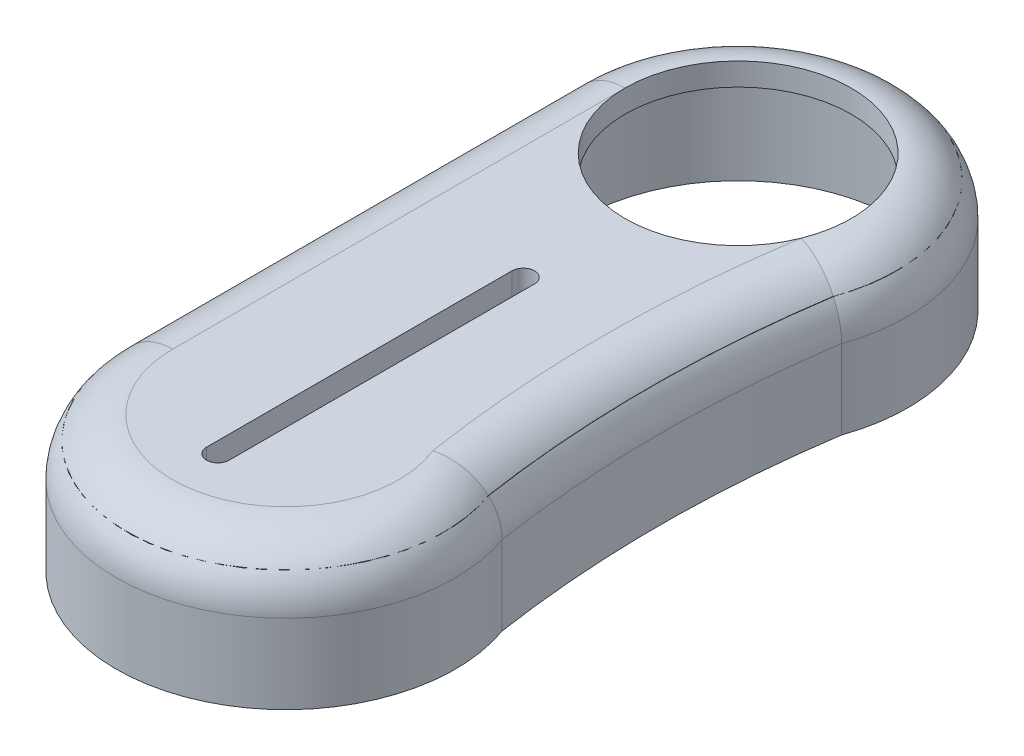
ISO-10303-21;
HEADER;
FILE_DESCRIPTION(('STEP AP214'),'2;1');
FILE_NAME('part.step','',(''),(''),'','','');
FILE_SCHEMA(('AUTOMOTIVE_DESIGN { 1 0 10303 214 1 1 1 1 }'));
ENDSEC;
DATA;
#1=APPLICATION_CONTEXT('core data for automotive mechanical design processes');
#2=APPLICATION_PROTOCOL_DEFINITION('international standard','automotive_design',2000,#1);
#3=PRODUCT_CONTEXT('',#1,'mechanical');
#4=PRODUCT('Part','Part','',(#3));
#5=PRODUCT_RELATED_PRODUCT_CATEGORY('part','',(#4));
#6=PRODUCT_DEFINITION_FORMATION('','',#4);
#7=PRODUCT_DEFINITION_CONTEXT('part definition',#1,'design');
#8=PRODUCT_DEFINITION('design','',#6,#7);
#9=PRODUCT_DEFINITION_SHAPE('','',#8);
#10=(LENGTH_UNIT() NAMED_UNIT(*) SI_UNIT(.MILLI.,.METRE.));
#11=(NAMED_UNIT(*) PLANE_ANGLE_UNIT() SI_UNIT($,.RADIAN.));
#12=(NAMED_UNIT(*) SI_UNIT($,.STERADIAN.) SOLID_ANGLE_UNIT());
#13=UNCERTAINTY_MEASURE_WITH_UNIT(LENGTH_MEASURE(1.E-05),#10,'distance_accuracy_value','');
#14=(GEOMETRIC_REPRESENTATION_CONTEXT(3) GLOBAL_UNCERTAINTY_ASSIGNED_CONTEXT((#13)) GLOBAL_UNIT_ASSIGNED_CONTEXT((#10,
#11,#12)) REPRESENTATION_CONTEXT('',''));
#15=CARTESIAN_POINT('',(0.,0.,0.));
#16=DIRECTION('',(0.,0.,1.));
#17=DIRECTION('',(1.,0.,0.));
#18=AXIS2_PLACEMENT_3D('',#15,#16,#17);
#19=CARTESIAN_POINT('',(98.0107352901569,2.,-20.));
#20=DIRECTION('',(0.,-1.,0.));
#21=DIRECTION('',(0.,0.,-1.));
#22=AXIS2_PLACEMENT_3D('',#19,#20,#21);
#23=CYLINDRICAL_SURFACE('',#22,100.);
#24=DIRECTION('',(0.,-1.,0.));
#25=VECTOR('',#24,1.);
#26=CARTESIAN_POINT('',(-0.857864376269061,2.,-35.));
#27=LINE('',#26,#25);
#28=CARTESIAN_POINT('',(-0.857864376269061,-3.,-35.));
#29=VERTEX_POINT('',#28);
#30=CARTESIAN_POINT('',(-0.857864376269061,-10.,-35.));
#31=VERTEX_POINT('',#30);
#32=EDGE_CURVE('E276',#29,#31,#27,.T.);
#33=ORIENTED_EDGE('',*,*,#32,.F.);
#34=CARTESIAN_POINT('',(98.0107352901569,-3.,-20.));
#35=DIRECTION('',(0.,1.,0.));
#36=DIRECTION('',(0.,0.,1.));
#37=AXIS2_PLACEMENT_3D('',#34,#35,#36);
#38=CIRCLE('',#37,100.);
#39=CARTESIAN_POINT('',(-0.857864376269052,-3.,-5.));
#40=VERTEX_POINT('',#39);
#41=EDGE_CURVE('E68',#29,#40,#38,.T.);
#42=ORIENTED_EDGE('',*,*,#41,.T.);
#43=DIRECTION('',(0.,-1.,0.));
#44=VECTOR('',#43,1.);
#45=CARTESIAN_POINT('',(-0.857864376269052,2.,-5.));
#46=LINE('',#45,#44);
#47=CARTESIAN_POINT('',(-0.857864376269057,-10.,-5.00000000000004));
#48=VERTEX_POINT('',#47);
#49=EDGE_CURVE('E266',#40,#48,#46,.T.);
#50=ORIENTED_EDGE('',*,*,#49,.T.);
#51=CARTESIAN_POINT('',(98.0107352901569,-10.,-20.));
#52=DIRECTION('',(0.,1.,0.));
#53=DIRECTION('',(0.,0.,-1.));
#54=AXIS2_PLACEMENT_3D('',#51,#52,#53);
#55=CIRCLE('',#54,100.);
#56=EDGE_CURVE('E296',#31,#48,#55,.T.);
#57=ORIENTED_EDGE('',*,*,#56,.F.);
#58=EDGE_LOOP('',(#33,#42,#50,#57));
#59=FACE_BOUND('',#58,.T.);
#60=ADVANCED_FACE('F43',(#59),#23,.F.);
#61=CARTESIAN_POINT('',(-15.,2.,-40.));
#62=DIRECTION('',(0.,-1.,0.));
#63=DIRECTION('',(0.,0.,-1.));
#64=AXIS2_PLACEMENT_3D('',#61,#62,#63);
#65=CYLINDRICAL_SURFACE('',#64,15.);
#66=DIRECTION('',(0.,-1.,0.));
#67=VECTOR('',#66,1.);
#68=CARTESIAN_POINT('',(-30.,2.,-40.));
#69=LINE('',#68,#67);
#70=CARTESIAN_POINT('',(-30.,-3.,-40.));
#71=VERTEX_POINT('',#70);
#72=CARTESIAN_POINT('',(-30.,-10.,-40.));
#73=VERTEX_POINT('',#72);
#74=EDGE_CURVE('E274',#71,#73,#69,.T.);
#75=ORIENTED_EDGE('',*,*,#74,.F.);
#76=CARTESIAN_POINT('',(-15.,-3.,-40.));
#77=DIRECTION('',(0.,1.,0.));
#78=DIRECTION('',(0.,0.,1.));
#79=AXIS2_PLACEMENT_3D('',#76,#77,#78);
#80=CIRCLE('',#79,15.);
#81=EDGE_CURVE('E248',#71,#29,#80,.F.);
#82=ORIENTED_EDGE('',*,*,#81,.T.);
#83=ORIENTED_EDGE('',*,*,#32,.T.);
#84=CARTESIAN_POINT('',(-15.,-10.,-40.));
#85=DIRECTION('',(0.,-1.,0.));
#86=DIRECTION('',(0.,0.,-1.));
#87=AXIS2_PLACEMENT_3D('',#84,#85,#86);
#88=CIRCLE('',#87,15.);
#89=EDGE_CURVE('E301',#73,#31,#88,.T.);
#90=ORIENTED_EDGE('',*,*,#89,.F.);
#91=EDGE_LOOP('',(#75,#82,#83,#90));
#92=FACE_BOUND('',#91,.T.);
#93=ADVANCED_FACE('F291',(#92),#65,.T.);
#94=CARTESIAN_POINT('',(-30.,2.,0.));
#95=DIRECTION('',(1.,0.,0.));
#96=DIRECTION('',(0.,0.,-1.));
#97=AXIS2_PLACEMENT_3D('',#94,#95,#96);
#98=PLANE('',#97);
#99=DIRECTION('',(0.,-1.,0.));
#100=VECTOR('',#99,1.);
#101=CARTESIAN_POINT('',(-30.,2.,0.));
#102=LINE('',#101,#100);
#103=CARTESIAN_POINT('',(-30.,-3.,0.));
#104=VERTEX_POINT('',#103);
#105=CARTESIAN_POINT('',(-30.,-10.,0.));
#106=VERTEX_POINT('',#105);
#107=EDGE_CURVE('E267',#104,#106,#102,.T.);
#108=ORIENTED_EDGE('',*,*,#107,.F.);
#109=DIRECTION('',(0.,0.,1.));
#110=VECTOR('',#109,1.);
#111=CARTESIAN_POINT('',(-30.,-3.,-40.));
#112=LINE('',#111,#110);
#113=CARTESIAN_POINT('',(-30.,-3.,-19.));
#114=VERTEX_POINT('',#113);
#115=EDGE_CURVE('E11',#104,#114,#112,.F.);
#116=ORIENTED_EDGE('',*,*,#115,.T.);
#117=CARTESIAN_POINT('',(-30.,-4.,-19.));
#118=DIRECTION('',(-1.,0.,0.));
#119=DIRECTION('',(0.,0.,1.));
#120=AXIS2_PLACEMENT_3D('',#117,#118,#119);
#121=CIRCLE('',#120,1.);
#122=CARTESIAN_POINT('',(-30.,-5.,-19.));
#123=VERTEX_POINT('',#122);
#124=EDGE_CURVE('E194',#123,#114,#121,.T.);
#125=ORIENTED_EDGE('',*,*,#124,.F.);
#126=DIRECTION('',(0.,0.,1.));
#127=VECTOR('',#126,1.);
#128=CARTESIAN_POINT('',(-30.,-5.,-21.));
#129=LINE('',#128,#127);
#130=CARTESIAN_POINT('',(-30.,-5.,-21.));
#131=VERTEX_POINT('',#130);
#132=EDGE_CURVE('E203',#131,#123,#129,.T.);
#133=ORIENTED_EDGE('',*,*,#132,.F.);
#134=CARTESIAN_POINT('',(-30.,-4.,-21.));
#135=DIRECTION('',(-1.,0.,0.));
#136=DIRECTION('',(0.,0.,1.));
#137=AXIS2_PLACEMENT_3D('',#134,#135,#136);
#138=CIRCLE('',#137,1.);
#139=CARTESIAN_POINT('',(-30.,-3.,-21.));
#140=VERTEX_POINT('',#139);
#141=EDGE_CURVE('E174',#140,#131,#138,.T.);
#142=ORIENTED_EDGE('',*,*,#141,.F.);
#143=DIRECTION('',(0.,0.,1.));
#144=VECTOR('',#143,1.);
#145=CARTESIAN_POINT('',(-30.,-3.,-40.));
#146=LINE('',#145,#144);
#147=EDGE_CURVE('E52',#140,#71,#146,.F.);
#148=ORIENTED_EDGE('',*,*,#147,.T.);
#149=ORIENTED_EDGE('',*,*,#74,.T.);
#150=DIRECTION('',(0.,0.,-1.));
#151=VECTOR('',#150,1.);
#152=CARTESIAN_POINT('',(-30.,-10.,0.));
#153=LINE('',#152,#151);
#154=EDGE_CURVE('E306',#106,#73,#153,.T.);
#155=ORIENTED_EDGE('',*,*,#154,.F.);
#156=EDGE_LOOP('',(#108,#116,#125,#133,#142,#148,#149,#155));
#157=FACE_BOUND('',#156,.T.);
#158=CARTESIAN_POINT('',(-30.,-4.,-16.5));
#159=DIRECTION('',(-1.,0.,0.));
#160=DIRECTION('',(0.,0.,1.));
#161=AXIS2_PLACEMENT_3D('',#158,#159,#160);
#162=CIRCLE('',#161,0.625000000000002);
#163=CARTESIAN_POINT('',(-30.,-4.,-15.875));
#164=VERTEX_POINT('',#163);
#165=EDGE_CURVE('E420',#164,#164,#162,.T.);
#166=ORIENTED_EDGE('',*,*,#165,.F.);
#167=EDGE_LOOP('',(#166));
#168=FACE_BOUND('',#167,.T.);
#169=ADVANCED_FACE('F198',(#157,#168),#98,.F.);
#170=CARTESIAN_POINT('',(-15.,2.,0.));
#171=DIRECTION('',(0.,-1.,0.));
#172=DIRECTION('',(0.,0.,-1.));
#173=AXIS2_PLACEMENT_3D('',#170,#171,#172);
#174=CYLINDRICAL_SURFACE('',#173,15.);
#175=ORIENTED_EDGE('',*,*,#49,.F.);
#176=CARTESIAN_POINT('',(-15.,-3.,0.));
#177=DIRECTION('',(0.,1.,0.));
#178=DIRECTION('',(0.,0.,1.));
#179=AXIS2_PLACEMENT_3D('',#176,#177,#178);
#180=CIRCLE('',#179,15.);
#181=EDGE_CURVE('E60',#40,#104,#180,.F.);
#182=ORIENTED_EDGE('',*,*,#181,.T.);
#183=ORIENTED_EDGE('',*,*,#107,.T.);
#184=CARTESIAN_POINT('',(-15.,-10.,0.));
#185=DIRECTION('',(0.,-1.,0.));
#186=DIRECTION('',(0.,0.,-1.));
#187=AXIS2_PLACEMENT_3D('',#184,#185,#186);
#188=CIRCLE('',#187,15.);
#189=EDGE_CURVE('E458',#48,#106,#188,.T.);
#190=ORIENTED_EDGE('',*,*,#189,.F.);
#191=EDGE_LOOP('',(#175,#182,#183,#190));
#192=FACE_BOUND('',#191,.T.);
#193=ADVANCED_FACE('F365',(#192),#174,.T.);
#194=CARTESIAN_POINT('',(0.,2.,0.));
#195=DIRECTION('',(0.,1.,0.));
#196=DIRECTION('',(0.,0.,1.));
#197=AXIS2_PLACEMENT_3D('',#194,#195,#196);
#198=PLANE('',#197);
#199=CARTESIAN_POINT('',(-15.,2.,0.));
#200=DIRECTION('',(0.,1.,0.));
#201=DIRECTION('',(0.,0.,1.));
#202=AXIS2_PLACEMENT_3D('',#199,#200,#201);
#203=CIRCLE('',#202,9.99999999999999);
#204=CARTESIAN_POINT('',(-25.,2.,0.));
#205=VERTEX_POINT('',#204);
#206=CARTESIAN_POINT('',(-5.72067263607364,2.,-3.72747685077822));
#207=VERTEX_POINT('',#206);
#208=EDGE_CURVE('E254',#205,#207,#203,.T.);
#209=ORIENTED_EDGE('',*,*,#208,.T.);
#210=CARTESIAN_POINT('',(98.0107352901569,2.,-20.));
#211=DIRECTION('',(0.,1.,0.));
#212=DIRECTION('',(0.,0.,1.));
#213=AXIS2_PLACEMENT_3D('',#210,#211,#212);
#214=CIRCLE('',#213,105.);
#215=CARTESIAN_POINT('',(-5.72067263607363,2.,-36.2725231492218));
#216=VERTEX_POINT('',#215);
#217=EDGE_CURVE('E260',#207,#216,#214,.F.);
#218=ORIENTED_EDGE('',*,*,#217,.T.);
#219=CARTESIAN_POINT('',(-15.,2.,-40.));
#220=DIRECTION('',(0.,1.,0.));
#221=DIRECTION('',(0.,0.,1.));
#222=AXIS2_PLACEMENT_3D('',#219,#220,#221);
#223=CIRCLE('',#222,10.);
#224=CARTESIAN_POINT('',(-25.,2.,-40.));
#225=VERTEX_POINT('',#224);
#226=EDGE_CURVE('E257',#225,#216,#223,.T.);
#227=ORIENTED_EDGE('',*,*,#226,.F.);
#228=DIRECTION('',(0.,0.,1.));
#229=VECTOR('',#228,1.);
#230=CARTESIAN_POINT('',(-25.,2.,0.));
#231=LINE('',#230,#229);
#232=EDGE_CURVE('E249',#225,#205,#231,.T.);
#233=ORIENTED_EDGE('',*,*,#232,.T.);
#234=EDGE_LOOP('',(#209,#218,#227,#233));
#235=FACE_BOUND('',#234,.T.);
#236=CARTESIAN_POINT('',(-15.,2.,-21.));
#237=DIRECTION('',(0.,1.,0.));
#238=DIRECTION('',(0.,0.,1.));
#239=AXIS2_PLACEMENT_3D('',#236,#237,#238);
#240=CIRCLE('',#239,0.999999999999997);
#241=CARTESIAN_POINT('',(-14.,2.,-21.));
#242=VERTEX_POINT('',#241);
#243=CARTESIAN_POINT('',(-16.,2.,-21.));
#244=VERTEX_POINT('',#243);
#245=EDGE_CURVE('E262',#242,#244,#240,.T.);
#246=ORIENTED_EDGE('',*,*,#245,.F.);
#247=DIRECTION('',(0.,0.,-1.));
#248=VECTOR('',#247,1.);
#249=CARTESIAN_POINT('',(-14.,2.,-21.));
#250=LINE('',#249,#248);
#251=CARTESIAN_POINT('',(-14.,2.,6.));
#252=VERTEX_POINT('',#251);
#253=EDGE_CURVE('E283',#252,#242,#250,.T.);
#254=ORIENTED_EDGE('',*,*,#253,.F.);
#255=CARTESIAN_POINT('',(-15.,2.,6.));
#256=DIRECTION('',(0.,1.,0.));
#257=DIRECTION('',(0.,0.,1.));
#258=AXIS2_PLACEMENT_3D('',#255,#256,#257);
#259=CIRCLE('',#258,0.999999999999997);
#260=CARTESIAN_POINT('',(-16.,2.,6.));
#261=VERTEX_POINT('',#260);
#262=EDGE_CURVE('E280',#261,#252,#259,.T.);
#263=ORIENTED_EDGE('',*,*,#262,.F.);
#264=DIRECTION('',(0.,0.,1.));
#265=VECTOR('',#264,1.);
#266=CARTESIAN_POINT('',(-16.,2.,-21.));
#267=LINE('',#266,#265);
#268=EDGE_CURVE('E278',#244,#261,#267,.T.);
#269=ORIENTED_EDGE('',*,*,#268,.F.);
#270=EDGE_LOOP('',(#246,#254,#263,#269));
#271=FACE_BOUND('',#270,.T.);
#272=ADVANCED_FACE('F258',(#235,#271),#198,.T.);
#273=CARTESIAN_POINT('',(0.,0.,0.));
#274=DIRECTION('',(0.,1.,0.));
#275=DIRECTION('',(0.,0.,1.));
#276=AXIS2_PLACEMENT_3D('',#273,#274,#275);
#277=PLANE('',#276);
#278=CARTESIAN_POINT('',(98.0107352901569,0.,-20.));
#279=DIRECTION('',(0.,1.,0.));
#280=DIRECTION('',(0.,0.,-1.));
#281=AXIS2_PLACEMENT_3D('',#278,#279,#280);
#282=CIRCLE('',#281,101.);
#283=CARTESIAN_POINT('',(-1.83198392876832,0.,-35.2457016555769));
#284=VERTEX_POINT('',#283);
#285=CARTESIAN_POINT('',(-1.83198392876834,0.,-4.75429834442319));
#286=VERTEX_POINT('',#285);
#287=EDGE_CURVE('E432',#284,#286,#282,.T.);
#288=ORIENTED_EDGE('',*,*,#287,.T.);
#289=CARTESIAN_POINT('',(-15.,0.,0.));
#290=DIRECTION('',(0.,-1.,0.));
#291=DIRECTION('',(0.,0.,-1.));
#292=AXIS2_PLACEMENT_3D('',#289,#290,#291);
#293=CIRCLE('',#292,14.);
#294=CARTESIAN_POINT('',(-29.,0.,0.));
#295=VERTEX_POINT('',#294);
#296=EDGE_CURVE('E193',#286,#295,#293,.T.);
#297=ORIENTED_EDGE('',*,*,#296,.T.);
#298=DIRECTION('',(0.,0.,-1.));
#299=VECTOR('',#298,1.);
#300=CARTESIAN_POINT('',(-29.,0.,0.));
#301=LINE('',#300,#299);
#302=CARTESIAN_POINT('',(-29.,0.,-40.));
#303=VERTEX_POINT('',#302);
#304=EDGE_CURVE('E442',#295,#303,#301,.T.);
#305=ORIENTED_EDGE('',*,*,#304,.T.);
#306=CARTESIAN_POINT('',(-15.,0.,-40.));
#307=DIRECTION('',(0.,-1.,0.));
#308=DIRECTION('',(0.,0.,-1.));
#309=AXIS2_PLACEMENT_3D('',#306,#307,#308);
#310=CIRCLE('',#309,14.);
#311=EDGE_CURVE('E445',#303,#284,#310,.T.);
#312=ORIENTED_EDGE('',*,*,#311,.T.);
#313=EDGE_LOOP('',(#288,#297,#305,#312));
#314=FACE_BOUND('',#313,.T.);
#315=CARTESIAN_POINT('',(-15.,0.,-40.));
#316=DIRECTION('',(0.,1.,0.));
#317=DIRECTION('',(0.,0.,1.));
#318=AXIS2_PLACEMENT_3D('',#315,#316,#317);
#319=CIRCLE('',#318,10.);
#320=CARTESIAN_POINT('',(-15.,0.,-30.));
#321=VERTEX_POINT('',#320);
#322=EDGE_CURVE('E281',#321,#321,#319,.T.);
#323=ORIENTED_EDGE('',*,*,#322,.T.);
#324=EDGE_LOOP('',(#323));
#325=FACE_BOUND('',#324,.T.);
#326=DIRECTION('',(0.,0.,-1.));
#327=VECTOR('',#326,1.);
#328=CARTESIAN_POINT('',(-14.,0.,-21.));
#329=LINE('',#328,#327);
#330=CARTESIAN_POINT('',(-14.,0.,6.));
#331=VERTEX_POINT('',#330);
#332=CARTESIAN_POINT('',(-14.,0.,-21.));
#333=VERTEX_POINT('',#332);
#334=EDGE_CURVE('E318',#331,#333,#329,.T.);
#335=ORIENTED_EDGE('',*,*,#334,.T.);
#336=CARTESIAN_POINT('',(-15.,0.,-21.));
#337=DIRECTION('',(0.,1.,0.));
#338=DIRECTION('',(0.,0.,1.));
#339=AXIS2_PLACEMENT_3D('',#336,#337,#338);
#340=CIRCLE('',#339,0.999999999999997);
#341=CARTESIAN_POINT('',(-16.,0.,-21.));
#342=VERTEX_POINT('',#341);
#343=EDGE_CURVE('E300',#333,#342,#340,.T.);
#344=ORIENTED_EDGE('',*,*,#343,.T.);
#345=DIRECTION('',(0.,0.,1.));
#346=VECTOR('',#345,1.);
#347=CARTESIAN_POINT('',(-16.,0.,-21.));
#348=LINE('',#347,#346);
#349=CARTESIAN_POINT('',(-16.,0.,6.));
#350=VERTEX_POINT('',#349);
#351=EDGE_CURVE('E304',#342,#350,#348,.T.);
#352=ORIENTED_EDGE('',*,*,#351,.T.);
#353=CARTESIAN_POINT('',(-15.,0.,6.));
#354=DIRECTION('',(0.,1.,0.));
#355=DIRECTION('',(0.,0.,1.));
#356=AXIS2_PLACEMENT_3D('',#353,#354,#355);
#357=CIRCLE('',#356,0.999999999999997);
#358=EDGE_CURVE('E315',#350,#331,#357,.T.);
#359=ORIENTED_EDGE('',*,*,#358,.T.);
#360=EDGE_LOOP('',(#335,#344,#352,#359));
#361=FACE_BOUND('',#360,.T.);
#362=ADVANCED_FACE('F343',(#314,#325,#361),#277,.F.);
#363=CARTESIAN_POINT('',(-15.,0.,-21.));
#364=DIRECTION('',(0.,1.,0.));
#365=DIRECTION('',(0.,0.,1.));
#366=AXIS2_PLACEMENT_3D('',#363,#364,#365);
#367=CYLINDRICAL_SURFACE('',#366,0.999999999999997);
#368=ORIENTED_EDGE('',*,*,#245,.T.);
#369=DIRECTION('',(0.,1.,0.));
#370=VECTOR('',#369,1.);
#371=CARTESIAN_POINT('',(-16.,0.,-21.));
#372=LINE('',#371,#370);
#373=EDGE_CURVE('E321',#342,#244,#372,.T.);
#374=ORIENTED_EDGE('',*,*,#373,.F.);
#375=ORIENTED_EDGE('',*,*,#343,.F.);
#376=DIRECTION('',(0.,1.,0.));
#377=VECTOR('',#376,1.);
#378=CARTESIAN_POINT('',(-14.,0.,-21.));
#379=LINE('',#378,#377);
#380=EDGE_CURVE('E311',#333,#242,#379,.T.);
#381=ORIENTED_EDGE('',*,*,#380,.T.);
#382=EDGE_LOOP('',(#368,#374,#375,#381));
#383=FACE_BOUND('',#382,.T.);
#384=ADVANCED_FACE('F341',(#383),#367,.F.);
#385=CARTESIAN_POINT('',(-14.,0.,-21.));
#386=DIRECTION('',(1.,0.,0.));
#387=DIRECTION('',(0.,0.,-1.));
#388=AXIS2_PLACEMENT_3D('',#385,#386,#387);
#389=PLANE('',#388);
#390=ORIENTED_EDGE('',*,*,#253,.T.);
#391=ORIENTED_EDGE('',*,*,#380,.F.);
#392=ORIENTED_EDGE('',*,*,#334,.F.);
#393=DIRECTION('',(0.,1.,0.));
#394=VECTOR('',#393,1.);
#395=CARTESIAN_POINT('',(-14.,0.,6.));
#396=LINE('',#395,#394);
#397=EDGE_CURVE('E322',#331,#252,#396,.T.);
#398=ORIENTED_EDGE('',*,*,#397,.T.);
#399=EDGE_LOOP('',(#390,#391,#392,#398));
#400=FACE_BOUND('',#399,.T.);
#401=ADVANCED_FACE('F337',(#400),#389,.F.);
#402=CARTESIAN_POINT('',(-15.,0.,6.));
#403=DIRECTION('',(0.,1.,0.));
#404=DIRECTION('',(0.,0.,1.));
#405=AXIS2_PLACEMENT_3D('',#402,#403,#404);
#406=CYLINDRICAL_SURFACE('',#405,0.999999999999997);
#407=ORIENTED_EDGE('',*,*,#262,.T.);
#408=ORIENTED_EDGE('',*,*,#397,.F.);
#409=ORIENTED_EDGE('',*,*,#358,.F.);
#410=DIRECTION('',(0.,1.,0.));
#411=VECTOR('',#410,1.);
#412=CARTESIAN_POINT('',(-16.,0.,6.));
#413=LINE('',#412,#411);
#414=EDGE_CURVE('E270',#350,#261,#413,.T.);
#415=ORIENTED_EDGE('',*,*,#414,.T.);
#416=EDGE_LOOP('',(#407,#408,#409,#415));
#417=FACE_BOUND('',#416,.T.);
#418=ADVANCED_FACE('F332',(#417),#406,.F.);
#419=CARTESIAN_POINT('',(-16.,0.,-21.));
#420=DIRECTION('',(-1.,0.,0.));
#421=DIRECTION('',(0.,0.,1.));
#422=AXIS2_PLACEMENT_3D('',#419,#420,#421);
#423=PLANE('',#422);
#424=ORIENTED_EDGE('',*,*,#268,.T.);
#425=ORIENTED_EDGE('',*,*,#414,.F.);
#426=ORIENTED_EDGE('',*,*,#351,.F.);
#427=ORIENTED_EDGE('',*,*,#373,.T.);
#428=EDGE_LOOP('',(#424,#425,#426,#427));
#429=FACE_BOUND('',#428,.T.);
#430=ADVANCED_FACE('F344',(#429),#423,.F.);
#431=CARTESIAN_POINT('',(-15.,0.,-40.));
#432=DIRECTION('',(0.,1.,0.));
#433=DIRECTION('',(0.,0.,1.));
#434=AXIS2_PLACEMENT_3D('',#431,#432,#433);
#435=CYLINDRICAL_SURFACE('',#434,10.);
#436=EDGE_CURVE('E245',#216,#225,#223,.T.);
#437=ORIENTED_EDGE('',*,*,#436,.T.);
#438=ORIENTED_EDGE('',*,*,#226,.T.);
#439=EDGE_LOOP('',(#437,#438));
#440=FACE_BOUND('',#439,.T.);
#441=ORIENTED_EDGE('',*,*,#322,.F.);
#442=EDGE_LOOP('',(#441));
#443=FACE_BOUND('',#442,.T.);
#444=ADVANCED_FACE('F264',(#440,#443),#435,.F.);
#445=CARTESIAN_POINT('',(-15.,-10.,0.));
#446=DIRECTION('',(0.,-1.,0.));
#447=DIRECTION('',(0.,0.,-1.));
#448=AXIS2_PLACEMENT_3D('',#445,#446,#447);
#449=PLANE('',#448);
#450=ORIENTED_EDGE('',*,*,#189,.T.);
#451=ORIENTED_EDGE('',*,*,#154,.T.);
#452=ORIENTED_EDGE('',*,*,#89,.T.);
#453=ORIENTED_EDGE('',*,*,#56,.T.);
#454=EDGE_LOOP('',(#450,#451,#452,#453));
#455=FACE_BOUND('',#454,.T.);
#456=DIRECTION('',(0.,0.,-1.));
#457=VECTOR('',#456,1.);
#458=CARTESIAN_POINT('',(-29.,-10.,0.));
#459=LINE('',#458,#457);
#460=CARTESIAN_POINT('',(-29.,-10.,0.));
#461=VERTEX_POINT('',#460);
#462=CARTESIAN_POINT('',(-29.,-10.,-40.));
#463=VERTEX_POINT('',#462);
#464=EDGE_CURVE('E431',#461,#463,#459,.T.);
#465=ORIENTED_EDGE('',*,*,#464,.F.);
#466=CARTESIAN_POINT('',(-15.,-10.,0.));
#467=DIRECTION('',(0.,-1.,0.));
#468=DIRECTION('',(0.,0.,-1.));
#469=AXIS2_PLACEMENT_3D('',#466,#467,#468);
#470=CIRCLE('',#469,14.);
#471=CARTESIAN_POINT('',(-1.83198392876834,-10.,-4.75429834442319));
#472=VERTEX_POINT('',#471);
#473=EDGE_CURVE('E429',#472,#461,#470,.T.);
#474=ORIENTED_EDGE('',*,*,#473,.F.);
#475=CARTESIAN_POINT('',(98.0107352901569,-10.,-20.));
#476=DIRECTION('',(0.,1.,0.));
#477=DIRECTION('',(0.,0.,-1.));
#478=AXIS2_PLACEMENT_3D('',#475,#476,#477);
#479=CIRCLE('',#478,101.);
#480=CARTESIAN_POINT('',(-1.83198392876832,-10.,-35.2457016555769));
#481=VERTEX_POINT('',#480);
#482=EDGE_CURVE('E437',#481,#472,#479,.T.);
#483=ORIENTED_EDGE('',*,*,#482,.F.);
#484=CARTESIAN_POINT('',(-15.,-10.,-40.));
#485=DIRECTION('',(0.,-1.,0.));
#486=DIRECTION('',(0.,0.,-1.));
#487=AXIS2_PLACEMENT_3D('',#484,#485,#486);
#488=CIRCLE('',#487,14.);
#489=EDGE_CURVE('E434',#463,#481,#488,.T.);
#490=ORIENTED_EDGE('',*,*,#489,.F.);
#491=EDGE_LOOP('',(#465,#474,#483,#490));
#492=FACE_BOUND('',#491,.T.);
#493=ADVANCED_FACE('F352',(#455,#492),#449,.T.);
#494=CARTESIAN_POINT('',(-15.,-10.,0.));
#495=DIRECTION('',(0.,1.,0.));
#496=DIRECTION('',(0.,0.,1.));
#497=AXIS2_PLACEMENT_3D('',#494,#495,#496);
#498=CYLINDRICAL_SURFACE('',#497,14.);
#499=ORIENTED_EDGE('',*,*,#296,.F.);
#500=DIRECTION('',(0.,1.,0.));
#501=VECTOR('',#500,1.);
#502=CARTESIAN_POINT('',(-1.83198392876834,-10.,-4.75429834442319));
#503=LINE('',#502,#501);
#504=EDGE_CURVE('E439',#472,#286,#503,.T.);
#505=ORIENTED_EDGE('',*,*,#504,.F.);
#506=ORIENTED_EDGE('',*,*,#473,.T.);
#507=DIRECTION('',(0.,1.,0.));
#508=VECTOR('',#507,1.);
#509=CARTESIAN_POINT('',(-29.,-10.,0.));
#510=LINE('',#509,#508);
#511=EDGE_CURVE('E455',#461,#295,#510,.T.);
#512=ORIENTED_EDGE('',*,*,#511,.T.);
#513=EDGE_LOOP('',(#499,#505,#506,#512));
#514=FACE_BOUND('',#513,.T.);
#515=ADVANCED_FACE('F382',(#514),#498,.F.);
#516=CARTESIAN_POINT('',(-29.,-10.,0.));
#517=DIRECTION('',(1.,0.,0.));
#518=DIRECTION('',(0.,0.,-1.));
#519=AXIS2_PLACEMENT_3D('',#516,#517,#518);
#520=PLANE('',#519);
#521=CARTESIAN_POINT('',(-29.,-4.,-21.));
#522=DIRECTION('',(1.,0.,0.));
#523=DIRECTION('',(0.,0.,-1.));
#524=AXIS2_PLACEMENT_3D('',#521,#522,#523);
#525=CIRCLE('',#524,1.);
#526=CARTESIAN_POINT('',(-29.,-3.,-21.));
#527=VERTEX_POINT('',#526);
#528=CARTESIAN_POINT('',(-29.,-5.,-21.));
#529=VERTEX_POINT('',#528);
#530=EDGE_CURVE('E177',#527,#529,#525,.F.);
#531=ORIENTED_EDGE('',*,*,#530,.T.);
#532=DIRECTION('',(0.,0.,1.));
#533=VECTOR('',#532,1.);
#534=CARTESIAN_POINT('',(-29.,-5.,-21.));
#535=LINE('',#534,#533);
#536=CARTESIAN_POINT('',(-29.,-5.,-19.));
#537=VERTEX_POINT('',#536);
#538=EDGE_CURVE('E417',#529,#537,#535,.T.);
#539=ORIENTED_EDGE('',*,*,#538,.T.);
#540=CARTESIAN_POINT('',(-29.,-4.,-19.));
#541=DIRECTION('',(1.,0.,0.));
#542=DIRECTION('',(0.,0.,-1.));
#543=AXIS2_PLACEMENT_3D('',#540,#541,#542);
#544=CIRCLE('',#543,1.);
#545=CARTESIAN_POINT('',(-29.,-3.,-19.));
#546=VERTEX_POINT('',#545);
#547=EDGE_CURVE('E180',#537,#546,#544,.F.);
#548=ORIENTED_EDGE('',*,*,#547,.T.);
#549=DIRECTION('',(0.,0.,-1.));
#550=VECTOR('',#549,1.);
#551=CARTESIAN_POINT('',(-29.,-3.,-21.));
#552=LINE('',#551,#550);
#553=EDGE_CURVE('E181',#546,#527,#552,.T.);
#554=ORIENTED_EDGE('',*,*,#553,.T.);
#555=EDGE_LOOP('',(#531,#539,#548,#554));
#556=FACE_BOUND('',#555,.T.);
#557=CARTESIAN_POINT('',(-29.,-4.,-16.5));
#558=DIRECTION('',(1.,0.,0.));
#559=DIRECTION('',(0.,0.,-1.));
#560=AXIS2_PLACEMENT_3D('',#557,#558,#559);
#561=CIRCLE('',#560,0.625000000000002);
#562=CARTESIAN_POINT('',(-29.,-4.,-17.125));
#563=VERTEX_POINT('',#562);
#564=EDGE_CURVE('E241',#563,#563,#561,.F.);
#565=ORIENTED_EDGE('',*,*,#564,.T.);
#566=EDGE_LOOP('',(#565));
#567=FACE_BOUND('',#566,.T.);
#568=ORIENTED_EDGE('',*,*,#304,.F.);
#569=ORIENTED_EDGE('',*,*,#511,.F.);
#570=ORIENTED_EDGE('',*,*,#464,.T.);
#571=DIRECTION('',(0.,1.,0.));
#572=VECTOR('',#571,1.);
#573=CARTESIAN_POINT('',(-29.,-10.,-40.));
#574=LINE('',#573,#572);
#575=EDGE_CURVE('E453',#463,#303,#574,.T.);
#576=ORIENTED_EDGE('',*,*,#575,.T.);
#577=EDGE_LOOP('',(#568,#569,#570,#576));
#578=FACE_BOUND('',#577,.T.);
#579=ADVANCED_FACE('F385',(#556,#567,#578),#520,.T.);
#580=CARTESIAN_POINT('',(-15.,-10.,-40.));
#581=DIRECTION('',(0.,1.,0.));
#582=DIRECTION('',(0.,0.,1.));
#583=AXIS2_PLACEMENT_3D('',#580,#581,#582);
#584=CYLINDRICAL_SURFACE('',#583,14.);
#585=ORIENTED_EDGE('',*,*,#311,.F.);
#586=ORIENTED_EDGE('',*,*,#575,.F.);
#587=ORIENTED_EDGE('',*,*,#489,.T.);
#588=DIRECTION('',(0.,1.,0.));
#589=VECTOR('',#588,1.);
#590=CARTESIAN_POINT('',(-1.83198392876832,-10.,-35.2457016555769));
#591=LINE('',#590,#589);
#592=EDGE_CURVE('E451',#481,#284,#591,.T.);
#593=ORIENTED_EDGE('',*,*,#592,.T.);
#594=EDGE_LOOP('',(#585,#586,#587,#593));
#595=FACE_BOUND('',#594,.T.);
#596=ADVANCED_FACE('F389',(#595),#584,.F.);
#597=CARTESIAN_POINT('',(98.0107352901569,-10.,-20.));
#598=DIRECTION('',(0.,1.,0.));
#599=DIRECTION('',(0.,0.,1.));
#600=AXIS2_PLACEMENT_3D('',#597,#598,#599);
#601=CYLINDRICAL_SURFACE('',#600,101.);
#602=ORIENTED_EDGE('',*,*,#287,.F.);
#603=ORIENTED_EDGE('',*,*,#592,.F.);
#604=ORIENTED_EDGE('',*,*,#482,.T.);
#605=ORIENTED_EDGE('',*,*,#504,.T.);
#606=EDGE_LOOP('',(#602,#603,#604,#605));
#607=FACE_BOUND('',#606,.T.);
#608=ADVANCED_FACE('F393',(#607),#601,.T.);
#609=CARTESIAN_POINT('',(0.00100000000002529,-4.,-16.5));
#610=DIRECTION('',(-1.,0.,0.));
#611=DIRECTION('',(0.,0.,1.));
#612=AXIS2_PLACEMENT_3D('',#609,#610,#611);
#613=CYLINDRICAL_SURFACE('',#612,0.625000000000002);
#614=ORIENTED_EDGE('',*,*,#564,.F.);
#615=EDGE_LOOP('',(#614));
#616=FACE_BOUND('',#615,.T.);
#617=ORIENTED_EDGE('',*,*,#165,.T.);
#618=EDGE_LOOP('',(#617));
#619=FACE_BOUND('',#618,.T.);
#620=ADVANCED_FACE('F397',(#616,#619),#613,.F.);
#621=CARTESIAN_POINT('',(0.00100000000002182,-4.,-21.));
#622=DIRECTION('',(-1.,0.,0.));
#623=DIRECTION('',(0.,0.,1.));
#624=AXIS2_PLACEMENT_3D('',#621,#622,#623);
#625=CYLINDRICAL_SURFACE('',#624,1.);
#626=DIRECTION('',(-1.,0.,0.));
#627=VECTOR('',#626,1.);
#628=CARTESIAN_POINT('',(0.00100000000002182,-3.,-21.));
#629=LINE('',#628,#627);
#630=EDGE_CURVE('E169',#527,#140,#629,.T.);
#631=ORIENTED_EDGE('',*,*,#630,.T.);
#632=ORIENTED_EDGE('',*,*,#141,.T.);
#633=DIRECTION('',(-1.,0.,0.));
#634=VECTOR('',#633,1.);
#635=CARTESIAN_POINT('',(0.00100000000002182,-5.,-21.));
#636=LINE('',#635,#634);
#637=EDGE_CURVE('E415',#529,#131,#636,.T.);
#638=ORIENTED_EDGE('',*,*,#637,.F.);
#639=ORIENTED_EDGE('',*,*,#530,.F.);
#640=EDGE_LOOP('',(#631,#632,#638,#639));
#641=FACE_BOUND('',#640,.T.);
#642=ADVANCED_FACE('F171',(#641),#625,.F.);
#643=CARTESIAN_POINT('',(0.00100000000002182,-3.,-21.));
#644=DIRECTION('',(0.,1.,0.));
#645=DIRECTION('',(0.,0.,1.));
#646=AXIS2_PLACEMENT_3D('',#643,#644,#645);
#647=PLANE('',#646);
#648=DIRECTION('',(-1.,0.,0.));
#649=VECTOR('',#648,1.);
#650=CARTESIAN_POINT('',(0.00100000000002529,-3.,-19.));
#651=LINE('',#650,#649);
#652=EDGE_CURVE('E188',#546,#114,#651,.T.);
#653=ORIENTED_EDGE('',*,*,#652,.T.);
#654=DIRECTION('',(0.,0.,-1.));
#655=VECTOR('',#654,1.);
#656=CARTESIAN_POINT('',(-30.,-3.,-21.));
#657=LINE('',#656,#655);
#658=EDGE_CURVE('E185',#114,#140,#657,.T.);
#659=ORIENTED_EDGE('',*,*,#658,.T.);
#660=ORIENTED_EDGE('',*,*,#630,.F.);
#661=ORIENTED_EDGE('',*,*,#553,.F.);
#662=EDGE_LOOP('',(#653,#659,#660,#661));
#663=FACE_BOUND('',#662,.T.);
#664=ADVANCED_FACE('F186',(#663),#647,.F.);
#665=CARTESIAN_POINT('',(0.00100000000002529,-4.,-19.));
#666=DIRECTION('',(-1.,0.,0.));
#667=DIRECTION('',(0.,0.,1.));
#668=AXIS2_PLACEMENT_3D('',#665,#666,#667);
#669=CYLINDRICAL_SURFACE('',#668,1.);
#670=DIRECTION('',(-1.,0.,0.));
#671=VECTOR('',#670,1.);
#672=CARTESIAN_POINT('',(0.00100000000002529,-5.,-19.));
#673=LINE('',#672,#671);
#674=EDGE_CURVE('E204',#537,#123,#673,.T.);
#675=ORIENTED_EDGE('',*,*,#674,.T.);
#676=ORIENTED_EDGE('',*,*,#124,.T.);
#677=ORIENTED_EDGE('',*,*,#652,.F.);
#678=ORIENTED_EDGE('',*,*,#547,.F.);
#679=EDGE_LOOP('',(#675,#676,#677,#678));
#680=FACE_BOUND('',#679,.T.);
#681=ADVANCED_FACE('F406',(#680),#669,.F.);
#682=CARTESIAN_POINT('',(0.00100000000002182,-5.,-21.));
#683=DIRECTION('',(0.,-1.,0.));
#684=DIRECTION('',(0.,0.,-1.));
#685=AXIS2_PLACEMENT_3D('',#682,#683,#684);
#686=PLANE('',#685);
#687=ORIENTED_EDGE('',*,*,#637,.T.);
#688=ORIENTED_EDGE('',*,*,#132,.T.);
#689=ORIENTED_EDGE('',*,*,#674,.F.);
#690=ORIENTED_EDGE('',*,*,#538,.F.);
#691=EDGE_LOOP('',(#687,#688,#689,#690));
#692=FACE_BOUND('',#691,.T.);
#693=ADVANCED_FACE('F409',(#692),#686,.F.);
#694=CARTESIAN_POINT('',(-15.,-3.,0.));
#695=DIRECTION('',(0.,1.,0.));
#696=DIRECTION('',(0.,0.,1.));
#697=AXIS2_PLACEMENT_3D('',#694,#695,#696);
#698=TOROIDAL_SURFACE('',#697,9.99999999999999,5.);
#699=CARTESIAN_POINT('',(-0.857864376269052,-3.,-5.));
#700=CARTESIAN_POINT('',(-0.857849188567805,-2.85985179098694,-5.00000296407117));
#701=CARTESIAN_POINT('',(-0.8636056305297,-2.71970595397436,-4.99856329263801));
#702=CARTESIAN_POINT('',(-0.886551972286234,-2.44041999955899,-4.99282012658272));
#703=CARTESIAN_POINT('',(-0.903741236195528,-2.30127982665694,-4.98851679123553));
#704=CARTESIAN_POINT('',(-0.949425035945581,-2.02510164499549,-4.97707235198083));
#705=CARTESIAN_POINT('',(-0.977910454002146,-1.88806203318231,-4.96993353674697));
#706=CARTESIAN_POINT('',(-1.04597177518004,-1.61694487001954,-4.95286014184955));
#707=CARTESIAN_POINT('',(-1.08554755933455,-1.48286728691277,-4.94292559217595));
#708=CARTESIAN_POINT('',(-1.17551154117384,-1.21858944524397,-4.92031463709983));
#709=CARTESIAN_POINT('',(-1.22590251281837,-1.08839019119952,-4.90763752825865));
#710=CARTESIAN_POINT('',(-1.33714107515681,-0.832779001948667,-4.87961077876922));
#711=CARTESIAN_POINT('',(-1.39799250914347,-0.707368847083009,-4.86426015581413));
#712=CARTESIAN_POINT('',(-1.52965645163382,-0.462340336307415,-4.83098731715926));
#713=CARTESIAN_POINT('',(-1.60046336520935,-0.342718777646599,-4.81306654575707));
#714=CARTESIAN_POINT('',(-1.75157357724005,-0.109991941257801,-4.77474353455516));
#715=CARTESIAN_POINT('',(-1.8318801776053,0.00311105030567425,-4.75434043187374));
#716=CARTESIAN_POINT('',(-2.0015184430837,0.222135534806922,-4.71114166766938));
#717=CARTESIAN_POINT('',(-2.09086403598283,0.328045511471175,-4.68834231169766));
#718=CARTESIAN_POINT('',(-2.27782600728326,0.531750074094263,-4.64050965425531));
#719=CARTESIAN_POINT('',(-2.37544242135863,0.629544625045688,-4.61547634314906));
#720=CARTESIAN_POINT('',(-2.57828683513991,0.816382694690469,-4.56330912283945));
#721=CARTESIAN_POINT('',(-2.68351840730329,0.905422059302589,-4.53617422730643));
#722=CARTESIAN_POINT('',(-2.90075565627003,1.0740530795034,-4.47998237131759));
#723=CARTESIAN_POINT('',(-3.01275901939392,1.15364793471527,-4.45092606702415));
#724=CARTESIAN_POINT('',(-3.24331970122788,1.3032366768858,-4.39090996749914));
#725=CARTESIAN_POINT('',(-3.36190583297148,1.3731827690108,-4.35994172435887));
#726=CARTESIAN_POINT('',(-3.60423886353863,1.50251654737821,-4.29642431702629));
#727=CARTESIAN_POINT('',(-3.72798390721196,1.56190798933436,-4.26387572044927));
#728=CARTESIAN_POINT('',(-3.97974290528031,1.66973923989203,-4.19739395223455));
#729=CARTESIAN_POINT('',(-4.10775526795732,1.71818308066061,-4.16346129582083));
#730=CARTESIAN_POINT('',(-4.36713304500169,1.8038074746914,-4.09441742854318));
#731=CARTESIAN_POINT('',(-4.49849753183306,1.8409911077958,-4.05930654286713));
#732=CARTESIAN_POINT('',(-4.80521580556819,1.9137103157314,-3.97696037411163));
#733=CARTESIAN_POINT('',(-4.98147148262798,1.94508908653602,-3.92936918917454));
#734=CARTESIAN_POINT('',(-5.33583856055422,1.98762838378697,-3.83307886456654));
#735=CARTESIAN_POINT('',(-5.51394629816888,1.99882318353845,-3.78438174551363));
#736=CARTESIAN_POINT('',(-5.70148615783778,1.99997072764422,-3.73276084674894));
#737=CARTESIAN_POINT('',(-5.71107972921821,2.00000005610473,-3.7301192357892));
#738=CARTESIAN_POINT('',(-5.72067263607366,2.,-3.72747685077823));
#739=B_SPLINE_CURVE_WITH_KNOTS('',3,(#699,#700,#701,#702,#703,#704,#705,#706,#707,#708,#709,
#710,#711,#712,#713,#714,#715,#716,#717,#718,#719,#720,#721,#722,#723,#724,#725,#726,#727,#728,
#729,#730,#731,#732,#733,#734,#735,#736,#737,#738),.UNSPECIFIED.,.F.,.F.,(4,2,2,2,2,2,2,2,2,2,2,
2,2,2,2,2,2,2,2,4),(0.,0.420315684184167,0.840607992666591,1.26056174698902,1.68051099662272,
2.10056808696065,2.52077984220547,2.94075637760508,3.36087932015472,3.78165976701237,
4.20244202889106,4.62342298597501,5.04426091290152,5.46711383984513,5.88981599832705,
6.3123622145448,6.73479275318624,7.28941215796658,7.84308890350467,7.87294067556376),.UNSPECIFIED.);
#740=EDGE_CURVE('E233',#207,#40,#739,.F.);
#741=ORIENTED_EDGE('',*,*,#740,.F.);
#742=ORIENTED_EDGE('',*,*,#208,.F.);
#743=CARTESIAN_POINT('',(-25.,-3.,0.));
#744=DIRECTION('',(0.,0.,-1.));
#745=DIRECTION('',(-1.,0.,0.));
#746=AXIS2_PLACEMENT_3D('',#743,#744,#745);
#747=CIRCLE('',#746,5.);
#748=EDGE_CURVE('E47',#104,#205,#747,.T.);
#749=ORIENTED_EDGE('',*,*,#748,.F.);
#750=ORIENTED_EDGE('',*,*,#181,.F.);
#751=EDGE_LOOP('',(#741,#742,#749,#750));
#752=FACE_BOUND('',#751,.T.);
#753=ADVANCED_FACE('F230',(#752),#698,.T.);
#754=CARTESIAN_POINT('',(-25.,-3.,0.));
#755=DIRECTION('',(0.,0.,-1.));
#756=DIRECTION('',(-1.,0.,0.));
#757=AXIS2_PLACEMENT_3D('',#754,#755,#756);
#758=CYLINDRICAL_SURFACE('',#757,5.);
#759=ORIENTED_EDGE('',*,*,#748,.T.);
#760=ORIENTED_EDGE('',*,*,#232,.F.);
#761=CARTESIAN_POINT('',(-25.,-3.,-40.));
#762=DIRECTION('',(0.,0.,-1.));
#763=DIRECTION('',(-1.,0.,0.));
#764=AXIS2_PLACEMENT_3D('',#761,#762,#763);
#765=CIRCLE('',#764,5.);
#766=EDGE_CURVE('E209',#71,#225,#765,.T.);
#767=ORIENTED_EDGE('',*,*,#766,.F.);
#768=ORIENTED_EDGE('',*,*,#147,.F.);
#769=ORIENTED_EDGE('',*,*,#658,.F.);
#770=ORIENTED_EDGE('',*,*,#115,.F.);
#771=EDGE_LOOP('',(#759,#760,#767,#768,#769,#770));
#772=FACE_BOUND('',#771,.T.);
#773=ADVANCED_FACE('F45',(#772),#758,.T.);
#774=CARTESIAN_POINT('',(98.0107352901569,-3.,-20.));
#775=DIRECTION('',(0.,1.,0.));
#776=DIRECTION('',(0.,0.,1.));
#777=AXIS2_PLACEMENT_3D('',#774,#775,#776);
#778=TOROIDAL_SURFACE('',#777,105.,5.);
#779=ORIENTED_EDGE('',*,*,#740,.T.);
#780=ORIENTED_EDGE('',*,*,#41,.F.);
#781=CARTESIAN_POINT('',(-0.857864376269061,-3.,-35.));
#782=CARTESIAN_POINT('',(-0.857849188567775,-2.85985179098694,-34.9999970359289));
#783=CARTESIAN_POINT('',(-0.863605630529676,-2.71970595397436,-35.0014367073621));
#784=CARTESIAN_POINT('',(-0.886551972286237,-2.44041999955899,-35.0071798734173));
#785=CARTESIAN_POINT('',(-0.903741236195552,-2.30127982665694,-35.0114832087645));
#786=CARTESIAN_POINT('',(-0.94942503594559,-2.02510164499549,-35.0229276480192));
#787=CARTESIAN_POINT('',(-0.977910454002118,-1.88806203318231,-35.0300664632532));
#788=CARTESIAN_POINT('',(-1.04597177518,-1.61694487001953,-35.0471398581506));
#789=CARTESIAN_POINT('',(-1.08554755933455,-1.48286728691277,-35.0570744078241));
#790=CARTESIAN_POINT('',(-1.17551154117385,-1.21858944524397,-35.0796853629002));
#791=CARTESIAN_POINT('',(-1.22590251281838,-1.08839019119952,-35.0923624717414));
#792=CARTESIAN_POINT('',(-1.3371410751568,-0.832779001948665,-35.1203892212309));
#793=CARTESIAN_POINT('',(-1.39799250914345,-0.707368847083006,-35.135739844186));
#794=CARTESIAN_POINT('',(-1.5296564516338,-0.462340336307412,-35.1690126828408));
#795=CARTESIAN_POINT('',(-1.60046336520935,-0.342718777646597,-35.186933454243));
#796=CARTESIAN_POINT('',(-1.75157357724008,-0.109991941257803,-35.2252564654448));
#797=CARTESIAN_POINT('',(-1.83188017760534,0.00311105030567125,-35.2456595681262));
#798=CARTESIAN_POINT('',(-2.00151844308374,0.22213553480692,-35.2888583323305));
#799=CARTESIAN_POINT('',(-2.09086403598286,0.328045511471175,-35.3116576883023));
#800=CARTESIAN_POINT('',(-2.27782600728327,0.531750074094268,-35.3594903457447));
#801=CARTESIAN_POINT('',(-2.37544242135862,0.629544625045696,-35.384523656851));
#802=CARTESIAN_POINT('',(-2.5782868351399,0.816382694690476,-35.4366908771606));
#803=CARTESIAN_POINT('',(-2.68351840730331,0.905422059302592,-35.4638257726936));
#804=CARTESIAN_POINT('',(-2.90075565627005,1.0740530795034,-35.5200176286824));
#805=CARTESIAN_POINT('',(-3.01275901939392,1.15364793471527,-35.5490739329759));
#806=CARTESIAN_POINT('',(-3.24331970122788,1.30323667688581,-35.6090900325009));
#807=CARTESIAN_POINT('',(-3.36190583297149,1.37318276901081,-35.6400582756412));
#808=CARTESIAN_POINT('',(-3.60423886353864,1.50251654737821,-35.7035756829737));
#809=CARTESIAN_POINT('',(-3.72798390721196,1.56190798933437,-35.7361242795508));
#810=CARTESIAN_POINT('',(-3.97974290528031,1.66973923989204,-35.8026060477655));
#811=CARTESIAN_POINT('',(-4.10775526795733,1.71818308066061,-35.8365387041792));
#812=CARTESIAN_POINT('',(-4.36713304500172,1.8038074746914,-35.9055825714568));
#813=CARTESIAN_POINT('',(-4.49849753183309,1.8409911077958,-35.9406934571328));
#814=CARTESIAN_POINT('',(-4.80521580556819,1.9137103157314,-36.0230396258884));
#815=CARTESIAN_POINT('',(-4.98147148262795,1.94508908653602,-36.0706308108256));
#816=CARTESIAN_POINT('',(-5.33583856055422,1.98762838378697,-36.1669211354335));
#817=CARTESIAN_POINT('',(-5.51394629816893,1.99882318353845,-36.2156182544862));
#818=CARTESIAN_POINT('',(-5.70148615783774,1.99997072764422,-36.2672391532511));
#819=CARTESIAN_POINT('',(-5.71107972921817,2.00000005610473,-36.2698807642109));
#820=CARTESIAN_POINT('',(-5.72067263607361,2.,-36.2725231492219));
#821=B_SPLINE_CURVE_WITH_KNOTS('',3,(#781,#782,#783,#784,#785,#786,#787,#788,#789,#790,#791,
#792,#793,#794,#795,#796,#797,#798,#799,#800,#801,#802,#803,#804,#805,#806,#807,#808,#809,#810,
#811,#812,#813,#814,#815,#816,#817,#818,#819,#820),.UNSPECIFIED.,.F.,.F.,(4,2,2,2,2,2,2,2,2,2,2,
2,2,2,2,2,2,2,2,4),(0.,0.420315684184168,0.840607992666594,1.26056174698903,1.68051099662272,
2.10056808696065,2.52077984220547,2.94075637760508,3.36087932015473,3.78165976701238,
4.20244202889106,4.62342298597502,5.04426091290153,5.46711383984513,5.88981599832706,
6.3123622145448,6.73479275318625,7.28941215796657,7.84308890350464,7.87294067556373),.UNSPECIFIED.);
#822=EDGE_CURVE('E215',#216,#29,#821,.F.);
#823=ORIENTED_EDGE('',*,*,#822,.F.);
#824=ORIENTED_EDGE('',*,*,#217,.F.);
#825=EDGE_LOOP('',(#779,#780,#823,#824));
#826=FACE_BOUND('',#825,.T.);
#827=ADVANCED_FACE('F226',(#826),#778,.T.);
#828=CARTESIAN_POINT('',(-15.,-3.,-40.));
#829=DIRECTION('',(0.,1.,0.));
#830=DIRECTION('',(0.,0.,1.));
#831=AXIS2_PLACEMENT_3D('',#828,#829,#830);
#832=TOROIDAL_SURFACE('',#831,10.,5.);
#833=ORIENTED_EDGE('',*,*,#766,.T.);
#834=ORIENTED_EDGE('',*,*,#436,.F.);
#835=ORIENTED_EDGE('',*,*,#822,.T.);
#836=ORIENTED_EDGE('',*,*,#81,.F.);
#837=EDGE_LOOP('',(#833,#834,#835,#836));
#838=FACE_BOUND('',#837,.T.);
#839=ADVANCED_FACE('F223',(#838),#832,.T.);
#840=CLOSED_SHELL('',(#60,#93,#169,#193,#272,#362,#384,#401,#418,#430,#444,#493,#515,#579,#596,
#608,#620,#642,#664,#681,#693,#753,#773,#827,#839));
#841=MANIFOLD_SOLID_BREP('B2',#840);
#842=ADVANCED_BREP_SHAPE_REPRESENTATION('',(#18,#841),#14);
#843=SHAPE_DEFINITION_REPRESENTATION(#9,#842);
ENDSEC;
END-ISO-10303-21;
